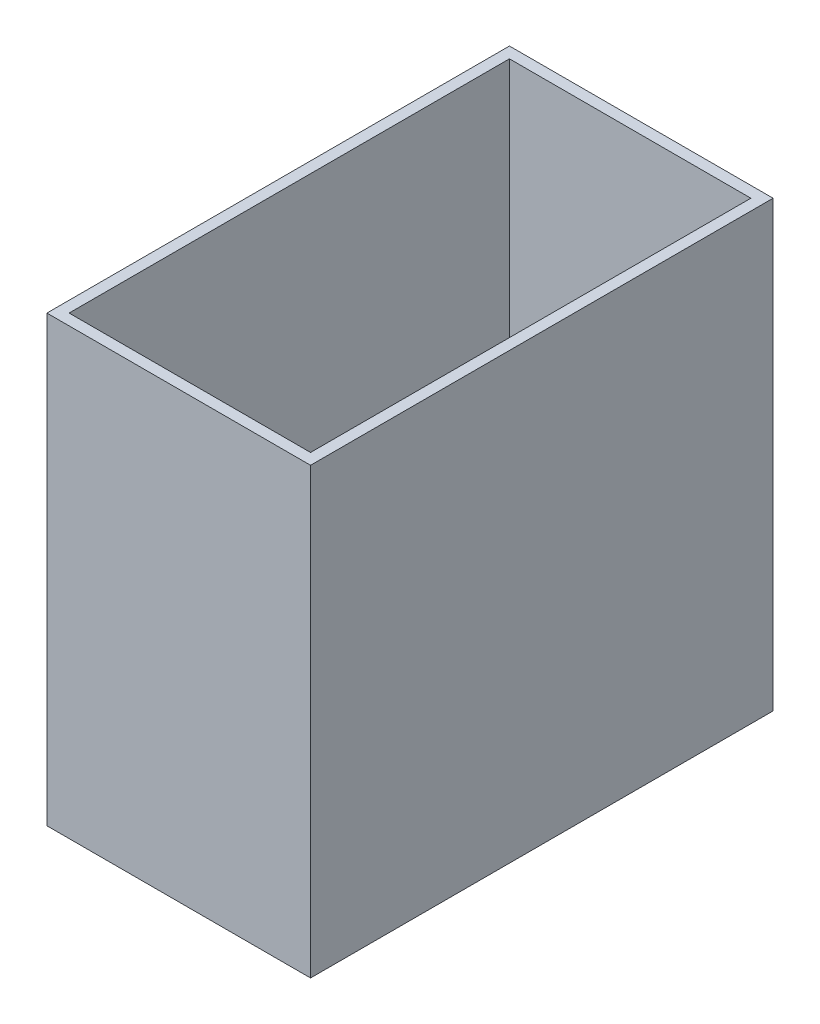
ISO-10303-21;
HEADER;
FILE_DESCRIPTION(('STEP AP214'),'2;1');
FILE_NAME('part.step','',(''),(''),'','','');
FILE_SCHEMA(('AUTOMOTIVE_DESIGN { 1 0 10303 214 1 1 1 1 }'));
ENDSEC;
DATA;
#1=APPLICATION_CONTEXT('core data for automotive mechanical design processes');
#2=APPLICATION_PROTOCOL_DEFINITION('international standard','automotive_design',2000,#1);
#3=PRODUCT_CONTEXT('',#1,'mechanical');
#4=PRODUCT('Part','Part','',(#3));
#5=PRODUCT_RELATED_PRODUCT_CATEGORY('part','',(#4));
#6=PRODUCT_DEFINITION_FORMATION('','',#4);
#7=PRODUCT_DEFINITION_CONTEXT('part definition',#1,'design');
#8=PRODUCT_DEFINITION('design','',#6,#7);
#9=PRODUCT_DEFINITION_SHAPE('','',#8);
#10=(LENGTH_UNIT() NAMED_UNIT(*) SI_UNIT(.MILLI.,.METRE.));
#11=(NAMED_UNIT(*) PLANE_ANGLE_UNIT() SI_UNIT($,.RADIAN.));
#12=(NAMED_UNIT(*) SI_UNIT($,.STERADIAN.) SOLID_ANGLE_UNIT());
#13=UNCERTAINTY_MEASURE_WITH_UNIT(LENGTH_MEASURE(1.E-05),#10,'distance_accuracy_value','');
#14=(GEOMETRIC_REPRESENTATION_CONTEXT(3) GLOBAL_UNCERTAINTY_ASSIGNED_CONTEXT((#13)) GLOBAL_UNIT_ASSIGNED_CONTEXT((#10,
#11,#12)) REPRESENTATION_CONTEXT('',''));
#15=CARTESIAN_POINT('',(0.,0.,0.));
#16=DIRECTION('',(0.,0.,1.));
#17=DIRECTION('',(1.,0.,0.));
#18=AXIS2_PLACEMENT_3D('',#15,#16,#17);
#19=CARTESIAN_POINT('',(0.,240.,0.));
#20=DIRECTION('',(1.,0.,0.));
#21=DIRECTION('',(0.,0.,-1.));
#22=AXIS2_PLACEMENT_3D('',#19,#20,#21);
#23=PLANE('',#22);
#24=DIRECTION('',(0.,0.,1.));
#25=VECTOR('',#24,1.);
#26=CARTESIAN_POINT('',(0.,0.,0.));
#27=LINE('',#26,#25);
#28=CARTESIAN_POINT('',(0.,0.,0.));
#29=VERTEX_POINT('',#28);
#30=CARTESIAN_POINT('',(0.,0.,250.));
#31=VERTEX_POINT('',#30);
#32=EDGE_CURVE('E164',#29,#31,#27,.T.);
#33=ORIENTED_EDGE('',*,*,#32,.T.);
#34=DIRECTION('',(0.,-1.,0.));
#35=VECTOR('',#34,1.);
#36=CARTESIAN_POINT('',(0.,240.,250.));
#37=LINE('',#36,#35);
#38=CARTESIAN_POINT('',(0.,240.,250.));
#39=VERTEX_POINT('',#38);
#40=EDGE_CURVE('E11',#39,#31,#37,.T.);
#41=ORIENTED_EDGE('',*,*,#40,.F.);
#42=DIRECTION('',(0.,0.,1.));
#43=VECTOR('',#42,1.);
#44=CARTESIAN_POINT('',(0.,240.,0.));
#45=LINE('',#44,#43);
#46=CARTESIAN_POINT('',(0.,240.,0.));
#47=VERTEX_POINT('',#46);
#48=EDGE_CURVE('E170',#47,#39,#45,.T.);
#49=ORIENTED_EDGE('',*,*,#48,.F.);
#50=DIRECTION('',(0.,-1.,0.));
#51=VECTOR('',#50,1.);
#52=CARTESIAN_POINT('',(0.,240.,0.));
#53=LINE('',#52,#51);
#54=EDGE_CURVE('E180',#47,#29,#53,.T.);
#55=ORIENTED_EDGE('',*,*,#54,.T.);
#56=EDGE_LOOP('',(#33,#41,#49,#55));
#57=FACE_BOUND('',#56,.T.);
#58=ADVANCED_FACE('F45',(#57),#23,.F.);
#59=CARTESIAN_POINT('',(0.,240.,250.));
#60=DIRECTION('',(0.,0.,-1.));
#61=DIRECTION('',(-1.,0.,0.));
#62=AXIS2_PLACEMENT_3D('',#59,#60,#61);
#63=PLANE('',#62);
#64=DIRECTION('',(1.,0.,0.));
#65=VECTOR('',#64,1.);
#66=CARTESIAN_POINT('',(0.,0.,250.));
#67=LINE('',#66,#65);
#68=CARTESIAN_POINT('',(142.5,0.,250.));
#69=VERTEX_POINT('',#68);
#70=EDGE_CURVE('E184',#31,#69,#67,.T.);
#71=ORIENTED_EDGE('',*,*,#70,.T.);
#72=DIRECTION('',(0.,-1.,0.));
#73=VECTOR('',#72,1.);
#74=CARTESIAN_POINT('',(142.5,240.,250.));
#75=LINE('',#74,#73);
#76=CARTESIAN_POINT('',(142.5,240.,250.));
#77=VERTEX_POINT('',#76);
#78=EDGE_CURVE('E53',#77,#69,#75,.T.);
#79=ORIENTED_EDGE('',*,*,#78,.F.);
#80=DIRECTION('',(1.,0.,0.));
#81=VECTOR('',#80,1.);
#82=CARTESIAN_POINT('',(0.,240.,250.));
#83=LINE('',#82,#81);
#84=EDGE_CURVE('E97',#39,#77,#83,.T.);
#85=ORIENTED_EDGE('',*,*,#84,.F.);
#86=ORIENTED_EDGE('',*,*,#40,.T.);
#87=EDGE_LOOP('',(#71,#79,#85,#86));
#88=FACE_BOUND('',#87,.T.);
#89=ADVANCED_FACE('F219',(#88),#63,.F.);
#90=CARTESIAN_POINT('',(142.5,240.,0.));
#91=DIRECTION('',(-1.,0.,0.));
#92=DIRECTION('',(0.,0.,1.));
#93=AXIS2_PLACEMENT_3D('',#90,#91,#92);
#94=PLANE('',#93);
#95=DIRECTION('',(0.,0.,-1.));
#96=VECTOR('',#95,1.);
#97=CARTESIAN_POINT('',(142.5,0.,0.));
#98=LINE('',#97,#96);
#99=CARTESIAN_POINT('',(142.5,0.,0.));
#100=VERTEX_POINT('',#99);
#101=EDGE_CURVE('E187',#69,#100,#98,.T.);
#102=ORIENTED_EDGE('',*,*,#101,.T.);
#103=DIRECTION('',(0.,-1.,0.));
#104=VECTOR('',#103,1.);
#105=CARTESIAN_POINT('',(142.5,240.,0.));
#106=LINE('',#105,#104);
#107=CARTESIAN_POINT('',(142.5,240.,0.));
#108=VERTEX_POINT('',#107);
#109=EDGE_CURVE('E194',#108,#100,#106,.T.);
#110=ORIENTED_EDGE('',*,*,#109,.F.);
#111=DIRECTION('',(0.,0.,-1.));
#112=VECTOR('',#111,1.);
#113=CARTESIAN_POINT('',(142.5,240.,0.));
#114=LINE('',#113,#112);
#115=EDGE_CURVE('E175',#77,#108,#114,.T.);
#116=ORIENTED_EDGE('',*,*,#115,.F.);
#117=ORIENTED_EDGE('',*,*,#78,.T.);
#118=EDGE_LOOP('',(#102,#110,#116,#117));
#119=FACE_BOUND('',#118,.T.);
#120=ADVANCED_FACE('F201',(#119),#94,.F.);
#121=CARTESIAN_POINT('',(0.,240.,0.));
#122=DIRECTION('',(0.,0.,1.));
#123=DIRECTION('',(1.,0.,0.));
#124=AXIS2_PLACEMENT_3D('',#121,#122,#123);
#125=PLANE('',#124);
#126=DIRECTION('',(-1.,0.,0.));
#127=VECTOR('',#126,1.);
#128=CARTESIAN_POINT('',(0.,0.,0.));
#129=LINE('',#128,#127);
#130=EDGE_CURVE('E90',#100,#29,#129,.T.);
#131=ORIENTED_EDGE('',*,*,#130,.T.);
#132=ORIENTED_EDGE('',*,*,#54,.F.);
#133=DIRECTION('',(-1.,0.,0.));
#134=VECTOR('',#133,1.);
#135=CARTESIAN_POINT('',(0.,240.,0.));
#136=LINE('',#135,#134);
#137=EDGE_CURVE('E69',#108,#47,#136,.T.);
#138=ORIENTED_EDGE('',*,*,#137,.F.);
#139=ORIENTED_EDGE('',*,*,#109,.T.);
#140=EDGE_LOOP('',(#131,#132,#138,#139));
#141=FACE_BOUND('',#140,.T.);
#142=ADVANCED_FACE('F209',(#141),#125,.F.);
#143=CARTESIAN_POINT('',(0.,240.,0.));
#144=DIRECTION('',(0.,1.,0.));
#145=DIRECTION('',(0.,0.,1.));
#146=AXIS2_PLACEMENT_3D('',#143,#144,#145);
#147=PLANE('',#146);
#148=DIRECTION('',(1.,0.,0.));
#149=VECTOR('',#148,1.);
#150=CARTESIAN_POINT('',(6.,240.,244.));
#151=LINE('',#150,#149);
#152=CARTESIAN_POINT('',(6.,240.,244.));
#153=VERTEX_POINT('',#152);
#154=CARTESIAN_POINT('',(136.5,240.,244.));
#155=VERTEX_POINT('',#154);
#156=EDGE_CURVE('E60',#153,#155,#151,.T.);
#157=ORIENTED_EDGE('',*,*,#156,.F.);
#158=DIRECTION('',(0.,0.,1.));
#159=VECTOR('',#158,1.);
#160=CARTESIAN_POINT('',(6.,240.,6.));
#161=LINE('',#160,#159);
#162=CARTESIAN_POINT('',(6.,240.,6.));
#163=VERTEX_POINT('',#162);
#164=EDGE_CURVE('E142',#163,#153,#161,.T.);
#165=ORIENTED_EDGE('',*,*,#164,.F.);
#166=DIRECTION('',(1.,0.,0.));
#167=VECTOR('',#166,1.);
#168=CARTESIAN_POINT('',(6.,240.,6.));
#169=LINE('',#168,#167);
#170=CARTESIAN_POINT('',(136.5,240.,6.));
#171=VERTEX_POINT('',#170);
#172=EDGE_CURVE('E146',#163,#171,#169,.T.);
#173=ORIENTED_EDGE('',*,*,#172,.T.);
#174=DIRECTION('',(0.,0.,1.));
#175=VECTOR('',#174,1.);
#176=CARTESIAN_POINT('',(136.5,240.,6.));
#177=LINE('',#176,#175);
#178=EDGE_CURVE('E155',#171,#155,#177,.T.);
#179=ORIENTED_EDGE('',*,*,#178,.T.);
#180=EDGE_LOOP('',(#157,#165,#173,#179));
#181=FACE_BOUND('',#180,.T.);
#182=ORIENTED_EDGE('',*,*,#48,.T.);
#183=ORIENTED_EDGE('',*,*,#84,.T.);
#184=ORIENTED_EDGE('',*,*,#115,.T.);
#185=ORIENTED_EDGE('',*,*,#137,.T.);
#186=EDGE_LOOP('',(#182,#183,#184,#185));
#187=FACE_BOUND('',#186,.T.);
#188=ADVANCED_FACE('F211',(#181,#187),#147,.T.);
#189=CARTESIAN_POINT('',(0.,0.,0.));
#190=DIRECTION('',(0.,1.,0.));
#191=DIRECTION('',(0.,0.,1.));
#192=AXIS2_PLACEMENT_3D('',#189,#190,#191);
#193=PLANE('',#192);
#194=ORIENTED_EDGE('',*,*,#32,.F.);
#195=ORIENTED_EDGE('',*,*,#130,.F.);
#196=ORIENTED_EDGE('',*,*,#101,.F.);
#197=ORIENTED_EDGE('',*,*,#70,.F.);
#198=EDGE_LOOP('',(#194,#195,#196,#197));
#199=FACE_BOUND('',#198,.T.);
#200=ADVANCED_FACE('F205',(#199),#193,.F.);
#201=CARTESIAN_POINT('',(6.,5.99999999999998,244.));
#202=DIRECTION('',(0.,0.,1.));
#203=DIRECTION('',(1.,0.,0.));
#204=AXIS2_PLACEMENT_3D('',#201,#202,#203);
#205=PLANE('',#204);
#206=ORIENTED_EDGE('',*,*,#156,.T.);
#207=DIRECTION('',(0.,1.,0.));
#208=VECTOR('',#207,1.);
#209=CARTESIAN_POINT('',(136.5,5.99999999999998,244.));
#210=LINE('',#209,#208);
#211=CARTESIAN_POINT('',(136.5,5.99999999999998,244.));
#212=VERTEX_POINT('',#211);
#213=EDGE_CURVE('E123',#212,#155,#210,.T.);
#214=ORIENTED_EDGE('',*,*,#213,.F.);
#215=DIRECTION('',(1.,0.,0.));
#216=VECTOR('',#215,1.);
#217=CARTESIAN_POINT('',(6.,5.99999999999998,244.));
#218=LINE('',#217,#216);
#219=CARTESIAN_POINT('',(6.,5.99999999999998,244.));
#220=VERTEX_POINT('',#219);
#221=EDGE_CURVE('E131',#220,#212,#218,.T.);
#222=ORIENTED_EDGE('',*,*,#221,.F.);
#223=DIRECTION('',(0.,1.,0.));
#224=VECTOR('',#223,1.);
#225=CARTESIAN_POINT('',(6.,5.99999999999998,244.));
#226=LINE('',#225,#224);
#227=EDGE_CURVE('E161',#220,#153,#226,.T.);
#228=ORIENTED_EDGE('',*,*,#227,.T.);
#229=EDGE_LOOP('',(#206,#214,#222,#228));
#230=FACE_BOUND('',#229,.T.);
#231=ADVANCED_FACE('F134',(#230),#205,.F.);
#232=CARTESIAN_POINT('',(6.,5.99999999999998,6.));
#233=DIRECTION('',(-1.,0.,0.));
#234=DIRECTION('',(0.,0.,1.));
#235=AXIS2_PLACEMENT_3D('',#232,#233,#234);
#236=PLANE('',#235);
#237=ORIENTED_EDGE('',*,*,#164,.T.);
#238=ORIENTED_EDGE('',*,*,#227,.F.);
#239=DIRECTION('',(0.,0.,1.));
#240=VECTOR('',#239,1.);
#241=CARTESIAN_POINT('',(6.,5.99999999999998,6.));
#242=LINE('',#241,#240);
#243=CARTESIAN_POINT('',(6.,5.99999999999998,6.));
#244=VERTEX_POINT('',#243);
#245=EDGE_CURVE('E137',#244,#220,#242,.T.);
#246=ORIENTED_EDGE('',*,*,#245,.F.);
#247=DIRECTION('',(0.,1.,0.));
#248=VECTOR('',#247,1.);
#249=CARTESIAN_POINT('',(6.,5.99999999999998,6.));
#250=LINE('',#249,#248);
#251=EDGE_CURVE('E165',#244,#163,#250,.T.);
#252=ORIENTED_EDGE('',*,*,#251,.T.);
#253=EDGE_LOOP('',(#237,#238,#246,#252));
#254=FACE_BOUND('',#253,.T.);
#255=ADVANCED_FACE('F258',(#254),#236,.F.);
#256=CARTESIAN_POINT('',(6.,5.99999999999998,6.));
#257=DIRECTION('',(0.,0.,1.));
#258=DIRECTION('',(1.,0.,0.));
#259=AXIS2_PLACEMENT_3D('',#256,#257,#258);
#260=PLANE('',#259);
#261=ORIENTED_EDGE('',*,*,#172,.F.);
#262=ORIENTED_EDGE('',*,*,#251,.F.);
#263=DIRECTION('',(1.,0.,0.));
#264=VECTOR('',#263,1.);
#265=CARTESIAN_POINT('',(6.,5.99999999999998,6.));
#266=LINE('',#265,#264);
#267=CARTESIAN_POINT('',(136.5,5.99999999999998,6.));
#268=VERTEX_POINT('',#267);
#269=EDGE_CURVE('E130',#244,#268,#266,.T.);
#270=ORIENTED_EDGE('',*,*,#269,.T.);
#271=DIRECTION('',(0.,1.,0.));
#272=VECTOR('',#271,1.);
#273=CARTESIAN_POINT('',(136.5,5.99999999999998,6.));
#274=LINE('',#273,#272);
#275=EDGE_CURVE('E125',#268,#171,#274,.T.);
#276=ORIENTED_EDGE('',*,*,#275,.T.);
#277=EDGE_LOOP('',(#261,#262,#270,#276));
#278=FACE_BOUND('',#277,.T.);
#279=ADVANCED_FACE('F267',(#278),#260,.T.);
#280=CARTESIAN_POINT('',(136.5,5.99999999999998,6.));
#281=DIRECTION('',(-1.,0.,0.));
#282=DIRECTION('',(0.,0.,1.));
#283=AXIS2_PLACEMENT_3D('',#280,#281,#282);
#284=PLANE('',#283);
#285=ORIENTED_EDGE('',*,*,#178,.F.);
#286=ORIENTED_EDGE('',*,*,#275,.F.);
#287=DIRECTION('',(0.,0.,1.));
#288=VECTOR('',#287,1.);
#289=CARTESIAN_POINT('',(136.5,5.99999999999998,6.));
#290=LINE('',#289,#288);
#291=EDGE_CURVE('E120',#268,#212,#290,.T.);
#292=ORIENTED_EDGE('',*,*,#291,.T.);
#293=ORIENTED_EDGE('',*,*,#213,.T.);
#294=EDGE_LOOP('',(#285,#286,#292,#293));
#295=FACE_BOUND('',#294,.T.);
#296=ADVANCED_FACE('F122',(#295),#284,.T.);
#297=CARTESIAN_POINT('',(0.,5.99999999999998,0.));
#298=DIRECTION('',(0.,-1.,0.));
#299=DIRECTION('',(0.,0.,-1.));
#300=AXIS2_PLACEMENT_3D('',#297,#298,#299);
#301=PLANE('',#300);
#302=ORIENTED_EDGE('',*,*,#221,.T.);
#303=ORIENTED_EDGE('',*,*,#291,.F.);
#304=ORIENTED_EDGE('',*,*,#269,.F.);
#305=ORIENTED_EDGE('',*,*,#245,.T.);
#306=EDGE_LOOP('',(#302,#303,#304,#305));
#307=FACE_BOUND('',#306,.T.);
#308=ADVANCED_FACE('F139',(#307),#301,.F.);
#309=CLOSED_SHELL('',(#58,#89,#120,#142,#188,#200,#231,#255,#279,#296,#308));
#310=MANIFOLD_SOLID_BREP('B2',#309);
#311=ADVANCED_BREP_SHAPE_REPRESENTATION('',(#18,#310),#14);
#312=SHAPE_DEFINITION_REPRESENTATION(#9,#311);
ENDSEC;
END-ISO-10303-21;
